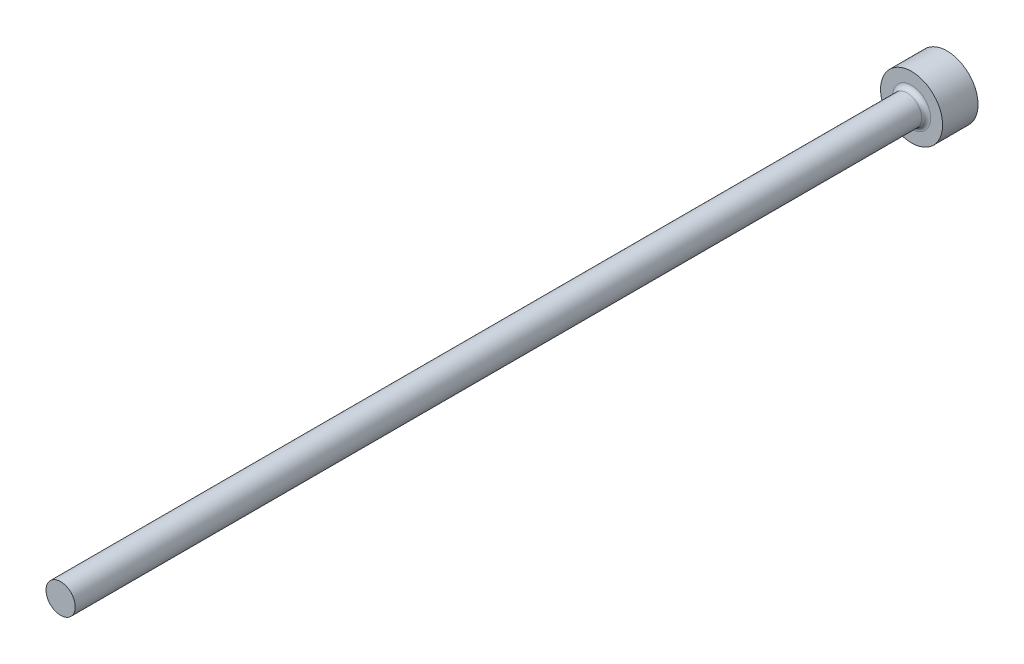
ISO-10303-21;
HEADER;
FILE_DESCRIPTION(('STEP AP214'),'2;1');
FILE_NAME('part.step','',(''),(''),'','','');
FILE_SCHEMA(('AUTOMOTIVE_DESIGN { 1 0 10303 214 1 1 1 1 }'));
ENDSEC;
DATA;
#1=APPLICATION_CONTEXT('core data for automotive mechanical design processes');
#2=APPLICATION_PROTOCOL_DEFINITION('international standard','automotive_design',2000,#1);
#3=PRODUCT_CONTEXT('',#1,'mechanical');
#4=PRODUCT('Part','Part','',(#3));
#5=PRODUCT_RELATED_PRODUCT_CATEGORY('part','',(#4));
#6=PRODUCT_DEFINITION_FORMATION('','',#4);
#7=PRODUCT_DEFINITION_CONTEXT('part definition',#1,'design');
#8=PRODUCT_DEFINITION('design','',#6,#7);
#9=PRODUCT_DEFINITION_SHAPE('','',#8);
#10=(LENGTH_UNIT() NAMED_UNIT(*) SI_UNIT(.MILLI.,.METRE.));
#11=(NAMED_UNIT(*) PLANE_ANGLE_UNIT() SI_UNIT($,.RADIAN.));
#12=(NAMED_UNIT(*) SI_UNIT($,.STERADIAN.) SOLID_ANGLE_UNIT());
#13=UNCERTAINTY_MEASURE_WITH_UNIT(LENGTH_MEASURE(1.E-05),#10,'distance_accuracy_value','');
#14=(GEOMETRIC_REPRESENTATION_CONTEXT(3) GLOBAL_UNCERTAINTY_ASSIGNED_CONTEXT((#13)) GLOBAL_UNIT_ASSIGNED_CONTEXT((#10,
#11,#12)) REPRESENTATION_CONTEXT('',''));
#15=CARTESIAN_POINT('',(0.,0.,0.));
#16=DIRECTION('',(0.,0.,1.));
#17=DIRECTION('',(1.,0.,0.));
#18=AXIS2_PLACEMENT_3D('',#15,#16,#17);
#19=CARTESIAN_POINT('',(3.5,0.,4.));
#20=DIRECTION('',(0.,0.,-1.));
#21=DIRECTION('',(-1.,0.,0.));
#22=AXIS2_PLACEMENT_3D('',#19,#20,#21);
#23=PLANE('',#22);
#24=CARTESIAN_POINT('',(0.,0.,4.));
#25=DIRECTION('',(0.,0.,-1.));
#26=DIRECTION('',(-1.,0.,0.));
#27=AXIS2_PLACEMENT_3D('',#24,#25,#26);
#28=CIRCLE('',#27,2.15000000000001);
#29=CARTESIAN_POINT('',(-2.15000000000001,0.,4.));
#30=VERTEX_POINT('',#29);
#31=EDGE_CURVE('E40',#30,#30,#28,.T.);
#32=ORIENTED_EDGE('',*,*,#31,.T.);
#33=EDGE_LOOP('',(#32));
#34=FACE_BOUND('',#33,.T.);
#35=CARTESIAN_POINT('',(0.,0.,4.));
#36=DIRECTION('',(0.,0.,-1.));
#37=DIRECTION('',(-1.,0.,0.));
#38=AXIS2_PLACEMENT_3D('',#35,#36,#37);
#39=CIRCLE('',#38,3.5);
#40=CARTESIAN_POINT('',(-3.5,0.,4.));
#41=VERTEX_POINT('',#40);
#42=EDGE_CURVE('E44',#41,#41,#39,.T.);
#43=ORIENTED_EDGE('',*,*,#42,.F.);
#44=EDGE_LOOP('',(#43));
#45=FACE_BOUND('',#44,.T.);
#46=ADVANCED_FACE('F33',(#34,#45),#23,.F.);
#47=CARTESIAN_POINT('',(0.,0.,-9.03322817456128));
#48=DIRECTION('',(0.,0.,-1.));
#49=DIRECTION('',(-1.,0.,0.));
#50=AXIS2_PLACEMENT_3D('',#47,#48,#49);
#51=CYLINDRICAL_SURFACE('',#50,3.5);
#52=CARTESIAN_POINT('',(0.,0.,0.));
#53=DIRECTION('',(0.,0.,-1.));
#54=DIRECTION('',(-1.,0.,0.));
#55=AXIS2_PLACEMENT_3D('',#52,#53,#54);
#56=CIRCLE('',#55,3.5);
#57=CARTESIAN_POINT('',(-3.5,0.,0.));
#58=VERTEX_POINT('',#57);
#59=EDGE_CURVE('E48',#58,#58,#56,.T.);
#60=ORIENTED_EDGE('',*,*,#59,.F.);
#61=EDGE_LOOP('',(#60));
#62=FACE_BOUND('',#61,.T.);
#63=ORIENTED_EDGE('',*,*,#42,.T.);
#64=EDGE_LOOP('',(#63));
#65=FACE_BOUND('',#64,.T.);
#66=ADVANCED_FACE('F68',(#62,#65),#51,.T.);
#67=CARTESIAN_POINT('',(0.,0.,0.));
#68=DIRECTION('',(0.,0.,1.));
#69=DIRECTION('',(1.,0.,0.));
#70=AXIS2_PLACEMENT_3D('',#67,#68,#69);
#71=PLANE('',#70);
#72=ORIENTED_EDGE('',*,*,#59,.T.);
#73=EDGE_LOOP('',(#72));
#74=FACE_BOUND('',#73,.T.);
#75=ADVANCED_FACE('F61',(#74),#71,.F.);
#76=CARTESIAN_POINT('',(0.,0.,100.));
#77=DIRECTION('',(0.,0.,-1.));
#78=DIRECTION('',(-1.,0.,0.));
#79=AXIS2_PLACEMENT_3D('',#76,#77,#78);
#80=PLANE('',#79);
#81=CARTESIAN_POINT('',(0.,0.,100.));
#82=DIRECTION('',(0.,0.,-1.));
#83=DIRECTION('',(-1.,0.,0.));
#84=AXIS2_PLACEMENT_3D('',#81,#82,#83);
#85=CIRCLE('',#84,1.65000000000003);
#86=CARTESIAN_POINT('',(-1.65000000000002,0.,100.));
#87=VERTEX_POINT('',#86);
#88=EDGE_CURVE('E53',#87,#87,#85,.T.);
#89=ORIENTED_EDGE('',*,*,#88,.F.);
#90=EDGE_LOOP('',(#89));
#91=FACE_BOUND('',#90,.T.);
#92=ADVANCED_FACE('F59',(#91),#80,.F.);
#93=CARTESIAN_POINT('',(0.,0.,-9.03322817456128));
#94=DIRECTION('',(0.,0.,-1.));
#95=DIRECTION('',(-1.,0.,0.));
#96=AXIS2_PLACEMENT_3D('',#93,#94,#95);
#97=CYLINDRICAL_SURFACE('',#96,1.65000000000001);
#98=CARTESIAN_POINT('',(0.,0.,4.5));
#99=DIRECTION('',(0.,0.,-1.));
#100=DIRECTION('',(-1.,0.,0.));
#101=AXIS2_PLACEMENT_3D('',#98,#99,#100);
#102=CIRCLE('',#101,1.65000000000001);
#103=CARTESIAN_POINT('',(-1.65000000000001,0.,4.5));
#104=VERTEX_POINT('',#103);
#105=EDGE_CURVE('E10',#104,#104,#102,.F.);
#106=ORIENTED_EDGE('',*,*,#105,.T.);
#107=EDGE_LOOP('',(#106));
#108=FACE_BOUND('',#107,.T.);
#109=ORIENTED_EDGE('',*,*,#88,.T.);
#110=EDGE_LOOP('',(#109));
#111=FACE_BOUND('',#110,.T.);
#112=ADVANCED_FACE('F57',(#108,#111),#97,.T.);
#113=CARTESIAN_POINT('',(0.,0.,4.5));
#114=DIRECTION('',(0.,0.,-1.));
#115=DIRECTION('',(-1.,0.,0.));
#116=AXIS2_PLACEMENT_3D('',#113,#114,#115);
#117=TOROIDAL_SURFACE('',#116,2.15000000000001,0.5);
#118=ORIENTED_EDGE('',*,*,#105,.F.);
#119=EDGE_LOOP('',(#118));
#120=FACE_BOUND('',#119,.T.);
#121=ORIENTED_EDGE('',*,*,#31,.F.);
#122=EDGE_LOOP('',(#121));
#123=FACE_BOUND('',#122,.T.);
#124=ADVANCED_FACE('F35',(#120,#123),#117,.F.);
#125=CLOSED_SHELL('',(#46,#66,#75,#92,#112,#124));
#126=MANIFOLD_SOLID_BREP('B2',#125);
#127=ADVANCED_BREP_SHAPE_REPRESENTATION('',(#18,#126),#14);
#128=SHAPE_DEFINITION_REPRESENTATION(#9,#127);
ENDSEC;
END-ISO-10303-21;
